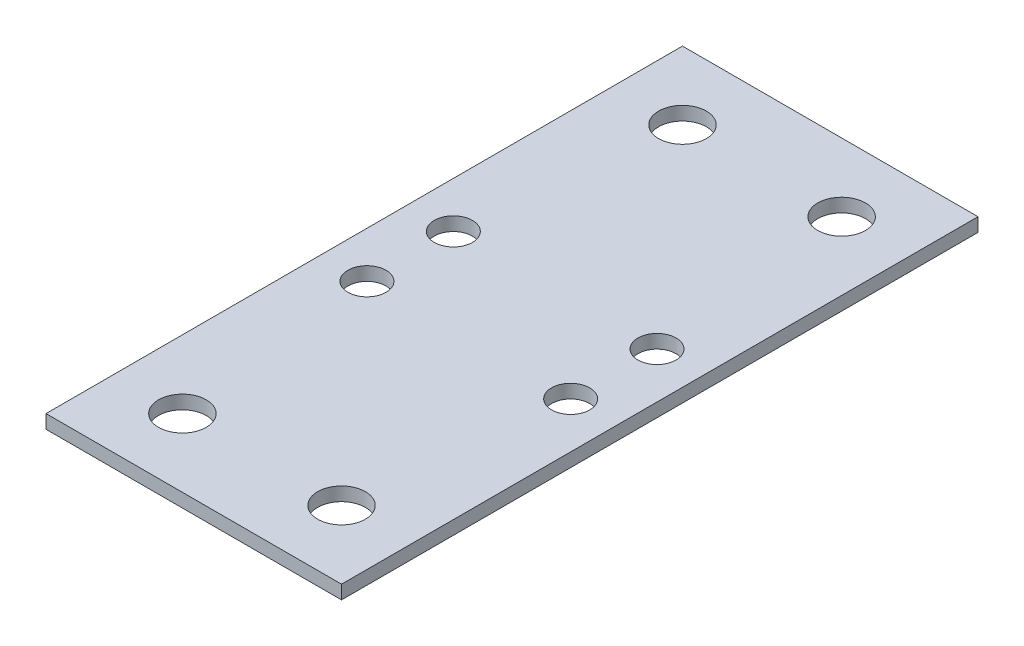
from build123d import *

# Parameters (mm, degrees)
SCHIZZO3_W                   = 65
SCHIZZO3_H                   = 140
ESTRUSIONE_ESTRUSIONE1_DEPTH = 3
FORO_PER_VITE_M8_1_D         = 8.4
FORO_PER_VITE_M10_1_D        = 10.5
FORO_PER_VITE_M10_1_DEPTH    = 30
FORO_PER_VITE_M10_1_TIP      = 3.15451825


with BuildPart() as part:
    # Schizzo3 → Estrusione-Estrusione1 (new body)
    with BuildSketch(Plane(origin=(0, 0, 0), x_dir=(1, 0, 0), z_dir=(0, 1, 0))):
        Rectangle(SCHIZZO3_W, SCHIZZO3_H)
    extrude(amount=ESTRUSIONE_ESTRUSIONE1_DEPTH)

    # Foro per Vite M8-1 (through all)
    with Locations(Plane(origin=(0, 0, 0), x_dir=(-1, 0, 0), z_dir=(0, -1, 0))):
        with Locations((22.4, -9.5), (-22.4, -9.5), (-22.4, 9.5), (22.4, 9.5)):
            Hole(FORO_PER_VITE_M8_1_D / 2)

    # Foro per Vite M10-1
    with Locations(Plane(origin=(0, 0, 0), x_dir=(-1, 0, 0), z_dir=(0, -1, 0))):
        with Locations((-17.5, -55), (-17.5, 55), (17.5, 55), (17.5, -55)):
            Hole(FORO_PER_VITE_M10_1_D / 2, depth=FORO_PER_VITE_M10_1_DEPTH)
            with Locations((0, 0, -(FORO_PER_VITE_M10_1_DEPTH + FORO_PER_VITE_M10_1_TIP / 2))):  # 118° drill point
                Cone(0, FORO_PER_VITE_M10_1_D / 2, FORO_PER_VITE_M10_1_TIP, mode=Mode.SUBTRACT)


solid = part.part
